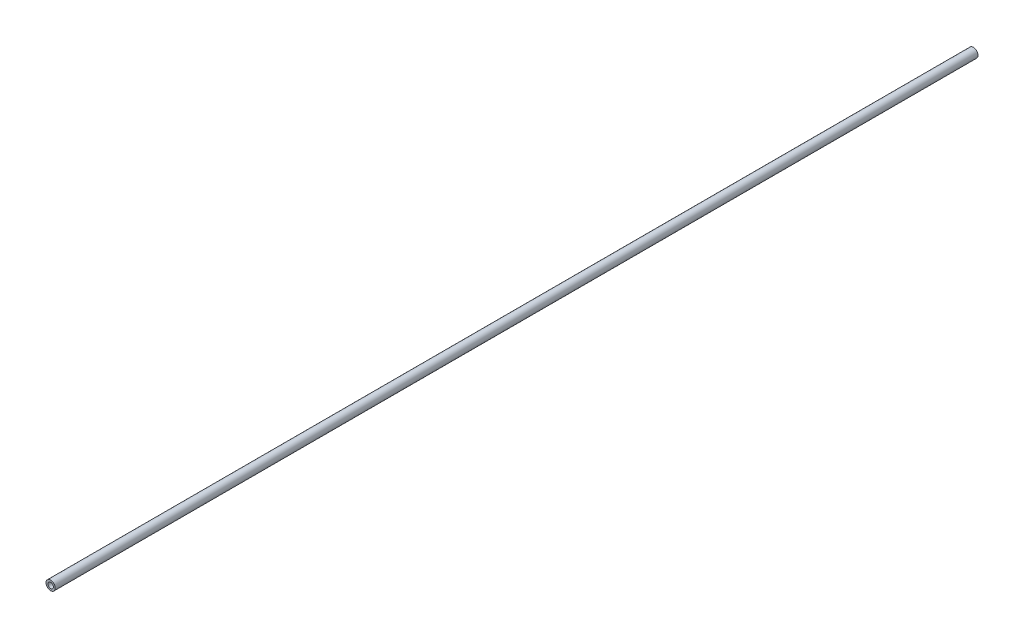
from build123d import *

# Parameters (mm, degrees)
SKETCH2_R   = 10
SKETCH2_R_2 = 6


with BuildPart() as part:
    # Sweep-Thin1: sweep along a path in Sketch1
    with BuildLine(Plane(origin=(0, 0, 0), x_dir=(0, 0, -1), z_dir=(1, 0, 0))) as sweep_thin1_path:
        Line((0, 0), (-2000, 0))
    # Sketch2 → Sweep-Thin1 (sweep)
    with BuildSketch(Plane.XY):
        Circle(SKETCH2_R)
        Circle(SKETCH2_R_2, mode=Mode.SUBTRACT)
    sweep(path=sweep_thin1_path.line)


solid = part.part
